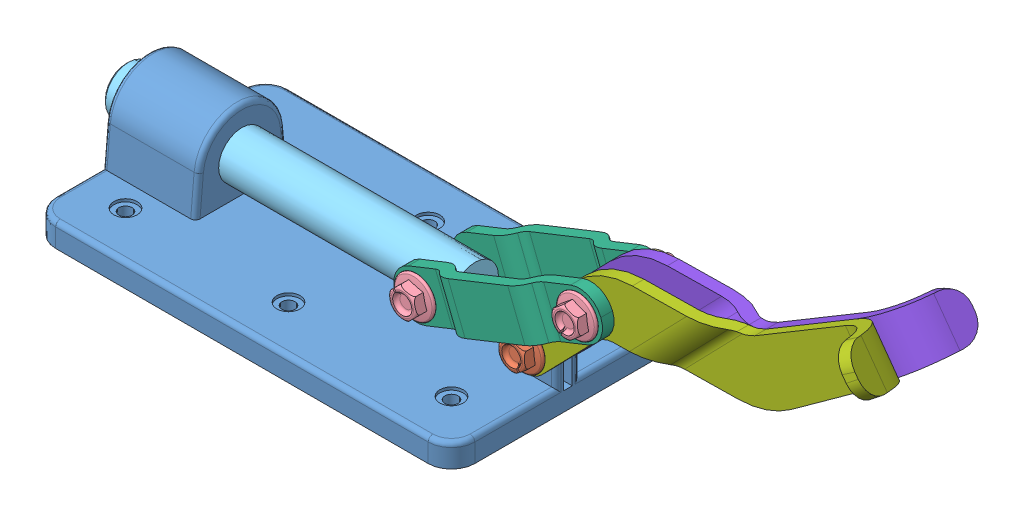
SolidWorks assembly plunger.sldasm, configuration AltPosition_MaxRange_1 (file format 15000). Lengths in mm.
Overall size (219.69 114 63.5).
12 component instances, 8 part files, 27 mates.
Components (placement in the parent):
- base_plunger-1: base_plunger.SLDPRT [Default] at origin
- short bolt_plunger-1: short bolt_plunger.SLDPRT [Default] at (109.22 15.24 6.35) x (0.598617 -0.801035 0) z (0 0 1)
- nut_plunger-1: nut_plunger.SLDPRT [Default] at (109.22 15.24 -6.35) x (-0.923728 -0.383049 0) z (0 0 -1)
- long bolt_plunger-1: long bolt_plunger.SLDPRT [Default] at (126.9077 33.4693 9.525) x (-0.358847 -0.933396 0) z (0 0 1)
- nut_plunger-2: nut_plunger.SLDPRT [Default] at (126.9077 33.4693 -9.525) x (0.937093 -0.349079 0) z (0 0 -1)
- long bolt_plunger-2: long bolt_plunger.SLDPRT [Default] at (82.6518 15.875 9.525) x (-0.700643 0.713512 0) z (0 0 1)
- nut_plunger-3: nut_plunger.SLDPRT [Default] at (82.6518 15.875 -9.525) x (-0.077903 -0.996961 0) z (0 0 -1)
- plunger-1: plunger.SLDPRT [Default] at (-6.2482 15.875 0)
- link_plunger-1: link_plunger.SLDPRT [Default] at (104.7797 24.6721 6.35) x (0.929257 0.369433 0) z (0 0 1)
- link_plunger-2: link_plunger.SLDPRT [Default] at (104.7797 24.6721 -6.35) x (0.929257 0.369433 0) z (0 0 -1)
- arm left-1: arm left.SLDPRT [Default] at (109.22 15.24 3.175) x (-0.696365 -0.717687 0) z (0 0 1)
- arm right-1: arm right.SLDPRT [Default] at (109.22 15.24 -3.175) x (-0.696365 -0.717687 0) z (0 0 1)
Mates (geometry in assembly coordinates):
- Concentric1: concentric aligned: cylinder of base_plunger-1 through (109.22 15.24 3.175) axis (0 0 1) radius 2.54; cylinder of short bolt_plunger-1 through (109.22 15.24 -13.65) axis (0 0 1) radius 2
- Coincident1: coincident anti-aligned: plane of base_plunger-1 through (109.22 15.24 3.175) normal (0 0 1); plane of arm left-1 through (10.5125 -77.8736 3.175) normal (0 0 -1)
- Concentric2: concentric anti-aligned: cylinder of arm right-1 through (109.22 15.24 0) axis (0 0 -1) radius 2.3813; cylinder of short bolt_plunger-1 through (109.22 15.24 -13.65) axis (0 0 1) radius 2
- Coincident2: coincident anti-aligned: plane of base_plunger-1 through (109.22 15.24 -3.175) normal (0 0 -1); plane of arm right-1 through (10.5125 -77.8736 -3.175) normal (0 0 1)
- Coincident4: coincident anti-aligned: plane of link_plunger-1 through (130.4626 41.7159 6.35) normal (0 0 -1); plane of arm left-1 through (109.22 15.24 6.35) normal (0 0 1)
- Coincident5: coincident anti-aligned: plane of arm right-1 through (109.22 15.24 -6.35) normal (0 0 -1); plane of link_plunger-2 through (135.1544 29.9144 -6.35) normal (0 0 1)
- Concentric4: concentric anti-aligned: cylinder of link_plunger-2 through (126.9077 33.4693 -6.35) axis (0 0 -1) radius 2.3813; cylinder of long bolt_plunger-1 through (126.9077 33.4693 -15.475) axis (0 0 1) radius 2
- Concentric5: concentric aligned: cylinder of link_plunger-1 through (82.6518 15.875 6.35) axis (0 0 1) radius 2.3813; cylinder of long bolt_plunger-2 through (82.6518 15.875 -15.475) axis (0 0 1) radius 2
- Concentric6: concentric anti-aligned: cylinder of base_plunger-1 through (25.4 15.875 0) axis (1 0 0) radius 6.35; cylinder of plunger-1 through (89.0018 15.875 0) axis (-1 0 0) radius 6.35
- Concentric7: concentric aligned: cylinder of plunger-1 through (82.6518 15.875 -6.35) axis (0 0 1) radius 2.3813; cylinder of long bolt_plunger-2 through (82.6518 15.875 -15.475) axis (0 0 1) radius 2
- Concentric8: concentric aligned: cylinder of long bolt_plunger-1 through (126.9077 33.4693 -15.475) axis (0 0 1) radius 2; cylinder of link_plunger-1 through (126.9077 33.4693 6.35) axis (0 0 1) radius 2.3813
- Concentric9: concentric anti-aligned: cylinder of long bolt_plunger-1 through (126.9077 33.4693 -15.475) axis (0 0 1) radius 2; cylinder of nut_plunger-2 through (126.9077 33.4693 -9.525) axis (0 0 -1) radius 2.04
- Concentric10: concentric aligned: cylinder of long bolt_plunger-2 through (82.6518 15.875 -15.475) axis (0 0 1) radius 2; cylinder of link_plunger-1 through (82.6518 15.875 6.35) axis (0 0 1) radius 2.3813
- Concentric11: concentric anti-aligned: cylinder of long bolt_plunger-2 through (82.6518 15.875 -15.475) axis (0 0 1) radius 2; cylinder of nut_plunger-3 through (82.6518 15.875 -9.525) axis (0 0 -1) radius 2.04
- Coincident6: coincident anti-aligned: plane of nut_plunger-2 through (125.4969 29.682 -9.525) normal (0 0 1); plane of link_plunger-2 through (135.1544 29.9144 -9.525) normal (0 0 -1)
- Coincident7: coincident anti-aligned: plane of long bolt_plunger-1 through (130.68 32.019 9.525) normal (0 0 -1); plane of link_plunger-1 through (130.4626 41.7159 9.525) normal (0 0 1)
- Coincident8: coincident anti-aligned: plane of nut_plunger-3 through (78.6226 16.1898 -9.525) normal (0 0 1); plane of link_plunger-2 through (79.0969 7.6283 -9.525) normal (0 0 -1)
- Coincident9: coincident anti-aligned: plane of long bolt_plunger-2 through (79.7682 13.0434 9.525) normal (0 0 -1); plane of link_plunger-1 through (74.4051 19.4299 9.525) normal (0 0 1)
- Concentric12: concentric aligned: cylinder of short bolt_plunger-1 through (109.22 15.24 -13.65) axis (0 0 1) radius 2; cylinder of arm left-1 through (109.22 15.24 0) axis (0 0 1) radius 2.3813
- Coincident10: coincident anti-aligned: plane of short bolt_plunger-1 through (112.4573 17.6593 6.35) normal (0 0 -1); plane of arm left-1 through (109.22 15.24 6.35) normal (0 0 1)
- Concentric13: concentric anti-aligned: cylinder of short bolt_plunger-1 through (109.22 15.24 -13.65) axis (0 0 1) radius 2; cylinder of nut_plunger-1 through (109.22 15.24 -6.35) axis (0 0 -1) radius 2.04
- Coincident11: coincident anti-aligned: plane of nut_plunger-1 through (107.6719 18.9732 -6.35) normal (0 0 1); plane of arm right-1 through (109.22 15.24 -6.35) normal (0 0 -1)
- Concentric14: concentric aligned: cylinder of long bolt_plunger-1 through (126.9077 33.4693 -15.475) axis (0 0 1) radius 2; cylinder of arm left-1 through (126.9077 33.4693 0) axis (0 0 1) radius 2.3813
- Coincident12: coincident anti-aligned: plane of arm left-1 through (109.22 15.24 0) normal (0 0 -1); plane of arm right-1 through (109.22 15.24 0) normal (0 0 1)
- Concentric15: concentric anti-aligned: cylinder of long bolt_plunger-2 through (82.6518 15.875 -15.475) axis (0 0 1) radius 2; cylinder of link_plunger-2 through (82.6518 15.875 -6.35) axis (0 0 -1) radius 2.3813
- Concentric16: concentric anti-aligned: cylinder of long bolt_plunger-1 through (126.9077 33.4693 -15.475) axis (0 0 1) radius 2; cylinder of arm right-1 through (126.9077 33.4693 0) axis (0 0 -1) radius 2.3813
- Perpendicular1: perpendicular: plane of base_plunger-1 through (0 0 31.75) normal (0 -1 0); plane of arm left-1
